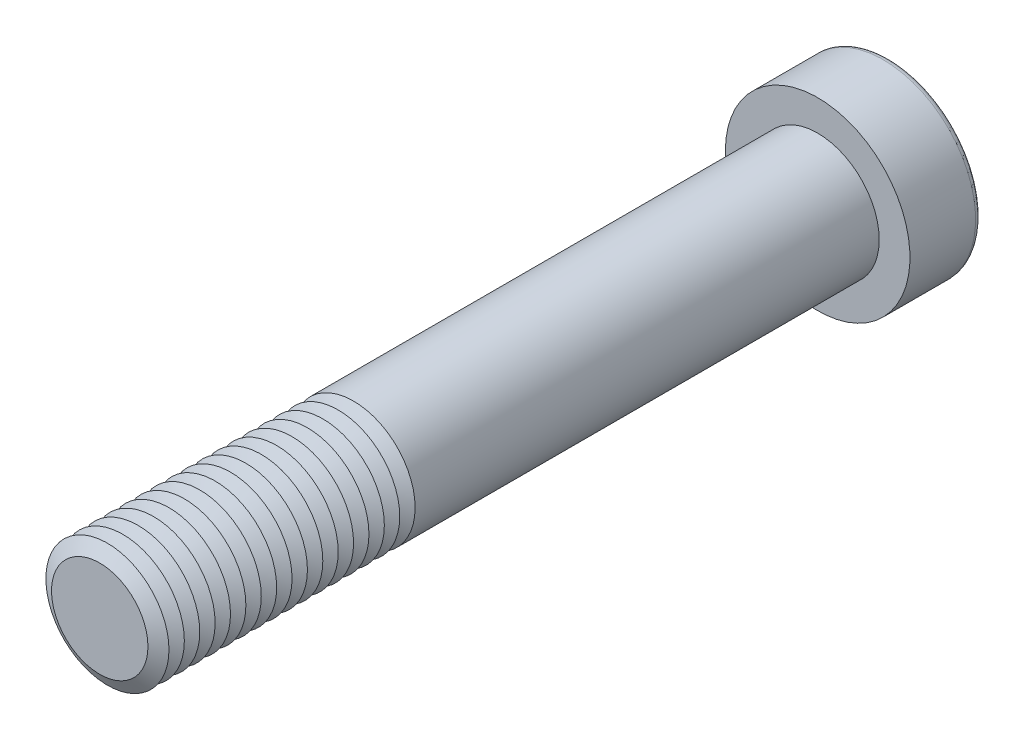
from build123d import *

# Parameters (mm, degrees)
SKETCH1_R           = 12
BOSS_EXTRUDE1_DEPTH = 140
SKETCH2_R           = 18
BOSS_EXTRUDE2_DEPTH = 14
CUT_EXTRUDE1_DEPTH  = 14.25
FILLET1_R           = 1.2
LPATTERN1_COUNT     = 17
LPATTERN1_PITCH     = 3


with BuildPart() as part:
    # Sketch1 → Boss-Extrude1 (new body)
    with BuildSketch(Plane.XY):
        Circle(SKETCH1_R)
    extrude(amount=BOSS_EXTRUDE1_DEPTH)

    # Sketch2 → Boss-Extrude2 (add)
    with BuildSketch(Plane(origin=(0, 0, 0), x_dir=(-1, 0, 0), z_dir=(0, 0, -1))):
        Circle(SKETCH2_R)
    extrude(amount=BOSS_EXTRUDE2_DEPTH)

    # Sketch3 → Cut-Extrude1 (cut)
    with BuildSketch(Plane(origin=(0, 0, -14), x_dir=(-1, 0, 0), z_dir=(0, 0, -1))):
        Polygon((-5.484827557, 9.5), (-10.969655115, 0), (-5.484827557, -9.5), (5.484827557, -9.5), (10.969655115, 0), (5.484827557, 9.5), align=None)
    extrude(amount=-CUT_EXTRUDE1_DEPTH, mode=Mode.SUBTRACT)

    # Fillet1
    fillet1_edges = [part.edges().sort_by_distance(p)[0] for p in [
        (18, 0, -14),
    ]]
    fillet(fillet1_edges, radius=FILLET1_R)

    # Cut-Extrude2 cone 1 section (on through the dimple's axis) → Cut-Extrude2 (revolve, cut)
    with BuildSketch(Plane(origin=(0, 0, 0.25), x_dir=(0, 1, 0), z_dir=(1, 0, 0))):
        Polygon((0, 0), (9.5, 0), (0, 5.484827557), align=None)
    revolve(axis=Axis((0, 0, 0.25), (0, 0, 1)), mode=Mode.SUBTRACT)

    # Cut-Extrude3 cone 1 section (on through the dimple's axis) → Cut-Extrude3 (revolve, cut)
    with BuildSketch(Plane(origin=(0, 0, -14), x_dir=(0, 1, 0), z_dir=(1, 0, 0))):
        Polygon((0, 0), (10.969655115, 0), (0, 2.939310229), align=None)
    revolve(axis=Axis((0, 0, -14), (0, 0, 1)), mode=Mode.SUBTRACT)

    # Sketch7 → Cut-Revolve1 (revolve, cut)
    with BuildSketch(Plane(origin=(0, 0, 0), x_dir=(0, 0, -1), z_dir=(1, 0, 0)), mode=Mode.PRIVATE) as cut_revolve1_sk:
        Polygon((-140, 9.401923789), (-138.5, 12), (-141.5, 12), align=None)
    cut_revolve1 = revolve(cut_revolve1_sk.sketch.rotate(Axis((0, 0, 140), (0, 0, -1)), 90), axis=Axis((0, 0, 140), (0, 0, -1)), mode=Mode.SUBTRACT)

    # LPattern1: Cut-Revolve1 ×17
    with Locations(*[(0, 0, -i * LPATTERN1_PITCH) for i in range(1, LPATTERN1_COUNT)]):
        add(cut_revolve1, mode=Mode.SUBTRACT)


solid = part.part
